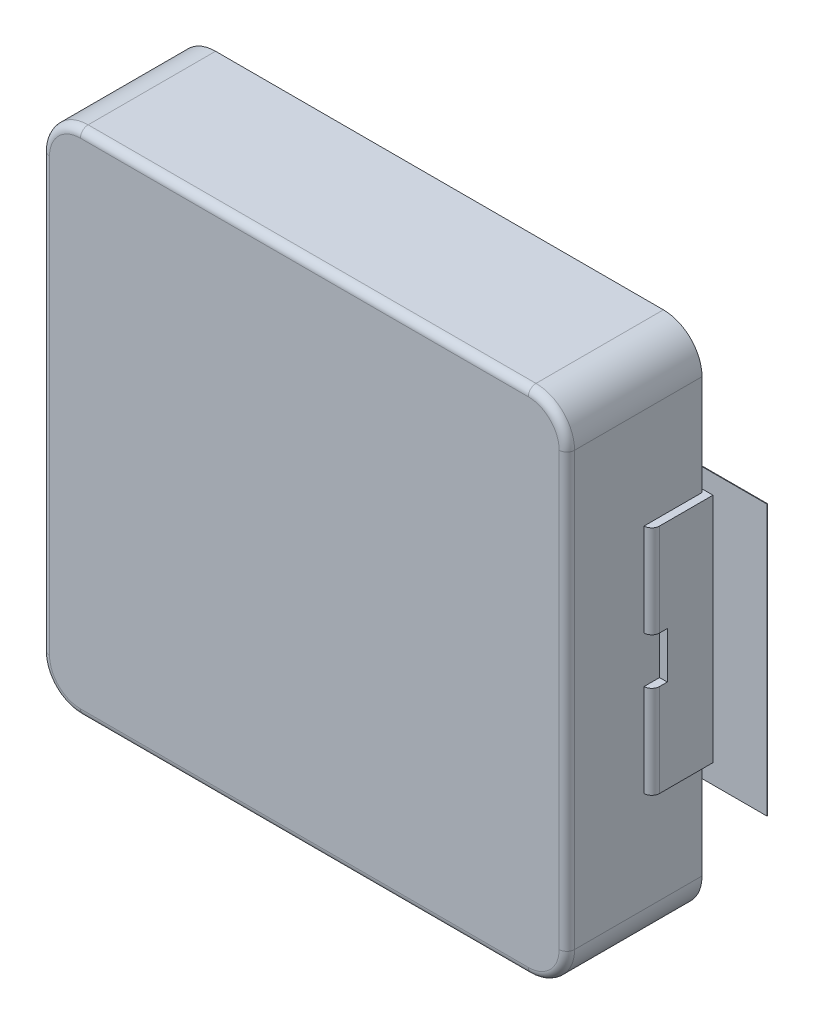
ISO-10303-21;
HEADER;
FILE_DESCRIPTION(('STEP AP214'),'2;1');
FILE_NAME('part.step','',(''),(''),'','','');
FILE_SCHEMA(('AUTOMOTIVE_DESIGN { 1 0 10303 214 1 1 1 1 }'));
ENDSEC;
DATA;
#1=APPLICATION_CONTEXT('core data for automotive mechanical design processes');
#2=APPLICATION_PROTOCOL_DEFINITION('international standard','automotive_design',2000,#1);
#3=PRODUCT_CONTEXT('',#1,'mechanical');
#4=PRODUCT('Part','Part','',(#3));
#5=PRODUCT_RELATED_PRODUCT_CATEGORY('part','',(#4));
#6=PRODUCT_DEFINITION_FORMATION('','',#4);
#7=PRODUCT_DEFINITION_CONTEXT('part definition',#1,'design');
#8=PRODUCT_DEFINITION('design','',#6,#7);
#9=PRODUCT_DEFINITION_SHAPE('','',#8);
#10=(LENGTH_UNIT() NAMED_UNIT(*) SI_UNIT(.MILLI.,.METRE.));
#11=(NAMED_UNIT(*) PLANE_ANGLE_UNIT() SI_UNIT($,.RADIAN.));
#12=(NAMED_UNIT(*) SI_UNIT($,.STERADIAN.) SOLID_ANGLE_UNIT());
#13=UNCERTAINTY_MEASURE_WITH_UNIT(LENGTH_MEASURE(1.E-05),#10,'distance_accuracy_value','');
#14=(GEOMETRIC_REPRESENTATION_CONTEXT(3) GLOBAL_UNCERTAINTY_ASSIGNED_CONTEXT((#13)) GLOBAL_UNIT_ASSIGNED_CONTEXT((#10,
#11,#12)) REPRESENTATION_CONTEXT('',''));
#15=CARTESIAN_POINT('',(0.,0.,0.));
#16=DIRECTION('',(0.,0.,1.));
#17=DIRECTION('',(1.,0.,0.));
#18=AXIS2_PLACEMENT_3D('',#15,#16,#17);
#19=CARTESIAN_POINT('',(3.50000000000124,-1.5000000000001,0.0762));
#20=DIRECTION('',(0.,0.,-1.));
#21=DIRECTION('',(-1.,0.,0.));
#22=AXIS2_PLACEMENT_3D('',#19,#20,#21);
#23=PLANE('',#22);
#24=DIRECTION('',(0.,1.,0.));
#25=VECTOR('',#24,1.);
#26=CARTESIAN_POINT('',(4.20000000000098,-1.75000000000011,0.0762));
#27=LINE('',#26,#25);
#28=CARTESIAN_POINT('',(4.20000000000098,-1.75000000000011,0.0762));
#29=VERTEX_POINT('',#28);
#30=CARTESIAN_POINT('',(4.20000000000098,1.75000000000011,0.0762));
#31=VERTEX_POINT('',#30);
#32=EDGE_CURVE('E429',#29,#31,#27,.T.);
#33=ORIENTED_EDGE('',*,*,#32,.F.);
#34=DIRECTION('',(1.,0.,0.));
#35=VECTOR('',#34,1.);
#36=CARTESIAN_POINT('',(1.25000000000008,-1.75000000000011,0.0762));
#37=LINE('',#36,#35);
#38=CARTESIAN_POINT('',(1.25000000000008,-1.75000000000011,0.0762));
#39=VERTEX_POINT('',#38);
#40=EDGE_CURVE('E280',#39,#29,#37,.T.);
#41=ORIENTED_EDGE('',*,*,#40,.F.);
#42=DIRECTION('',(0.,1.,0.));
#43=VECTOR('',#42,1.);
#44=CARTESIAN_POINT('',(1.25000000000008,1.75000000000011,0.0762));
#45=LINE('',#44,#43);
#46=CARTESIAN_POINT('',(1.25000000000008,1.75000000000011,0.0762));
#47=VERTEX_POINT('',#46);
#48=EDGE_CURVE('E419',#47,#39,#45,.F.);
#49=ORIENTED_EDGE('',*,*,#48,.F.);
#50=DIRECTION('',(1.,0.,0.));
#51=VECTOR('',#50,1.);
#52=CARTESIAN_POINT('',(4.20000000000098,1.75000000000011,0.0762));
#53=LINE('',#52,#51);
#54=EDGE_CURVE('E424',#31,#47,#53,.F.);
#55=ORIENTED_EDGE('',*,*,#54,.F.);
#56=EDGE_LOOP('',(#33,#41,#49,#55));
#57=FACE_BOUND('',#56,.T.);
#58=ADVANCED_FACE('F16',(#57),#23,.T.);
#59=CARTESIAN_POINT('',(3.50000000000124,-1.5000000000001,0.0762));
#60=DIRECTION('',(0.,0.,-1.));
#61=DIRECTION('',(-1.,0.,0.));
#62=AXIS2_PLACEMENT_3D('',#59,#60,#61);
#63=PLANE('',#62);
#64=DIRECTION('',(0.,1.,0.));
#65=VECTOR('',#64,1.);
#66=CARTESIAN_POINT('',(-1.25000000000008,-1.75000000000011,0.0762));
#67=LINE('',#66,#65);
#68=CARTESIAN_POINT('',(-1.25000000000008,-1.75000000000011,0.0762));
#69=VERTEX_POINT('',#68);
#70=CARTESIAN_POINT('',(-1.25000000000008,1.75000000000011,0.0762));
#71=VERTEX_POINT('',#70);
#72=EDGE_CURVE('E289',#69,#71,#67,.T.);
#73=ORIENTED_EDGE('',*,*,#72,.F.);
#74=DIRECTION('',(1.,0.,0.));
#75=VECTOR('',#74,1.);
#76=CARTESIAN_POINT('',(-4.20000000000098,-1.75000000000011,0.0762));
#77=LINE('',#76,#75);
#78=CARTESIAN_POINT('',(-4.20000000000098,-1.75000000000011,0.0762));
#79=VERTEX_POINT('',#78);
#80=EDGE_CURVE('E488',#79,#69,#77,.T.);
#81=ORIENTED_EDGE('',*,*,#80,.F.);
#82=DIRECTION('',(0.,1.,0.));
#83=VECTOR('',#82,1.);
#84=CARTESIAN_POINT('',(-4.20000000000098,1.75000000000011,0.0762));
#85=LINE('',#84,#83);
#86=CARTESIAN_POINT('',(-4.20000000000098,1.75000000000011,0.0762));
#87=VERTEX_POINT('',#86);
#88=EDGE_CURVE('E536',#87,#79,#85,.F.);
#89=ORIENTED_EDGE('',*,*,#88,.F.);
#90=DIRECTION('',(1.,0.,0.));
#91=VECTOR('',#90,1.);
#92=CARTESIAN_POINT('',(-1.25000000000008,1.75000000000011,0.0762));
#93=LINE('',#92,#91);
#94=EDGE_CURVE('E541',#71,#87,#93,.F.);
#95=ORIENTED_EDGE('',*,*,#94,.F.);
#96=EDGE_LOOP('',(#73,#81,#89,#95));
#97=FACE_BOUND('',#96,.T.);
#98=ADVANCED_FACE('F553',(#97),#63,.T.);
#99=CARTESIAN_POINT('',(4.20000000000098,-1.75000000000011,0.0762));
#100=DIRECTION('',(1.,0.,0.));
#101=DIRECTION('',(0.,0.,-1.));
#102=AXIS2_PLACEMENT_3D('',#99,#100,#101);
#103=PLANE('',#102);
#104=DIRECTION('',(0.,0.,-1.));
#105=VECTOR('',#104,1.);
#106=CARTESIAN_POINT('',(4.20000000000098,-1.75000000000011,0.0762));
#107=LINE('',#106,#105);
#108=CARTESIAN_POINT('',(4.20000000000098,-1.75000000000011,0.0841999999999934));
#109=VERTEX_POINT('',#108);
#110=EDGE_CURVE('E416',#29,#109,#107,.F.);
#111=ORIENTED_EDGE('',*,*,#110,.F.);
#112=ORIENTED_EDGE('',*,*,#32,.T.);
#113=DIRECTION('',(0.,0.,1.));
#114=VECTOR('',#113,1.);
#115=CARTESIAN_POINT('',(4.20000000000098,1.75000000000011,0.0762));
#116=LINE('',#115,#114);
#117=CARTESIAN_POINT('',(4.20000000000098,1.75000000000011,0.0841999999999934));
#118=VERTEX_POINT('',#117);
#119=EDGE_CURVE('E426',#118,#31,#116,.F.);
#120=ORIENTED_EDGE('',*,*,#119,.F.);
#121=DIRECTION('',(0.,1.,0.));
#122=VECTOR('',#121,1.);
#123=CARTESIAN_POINT('',(4.20000000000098,0.,0.0841999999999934));
#124=LINE('',#123,#122);
#125=EDGE_CURVE('E466',#109,#118,#124,.T.);
#126=ORIENTED_EDGE('',*,*,#125,.F.);
#127=EDGE_LOOP('',(#111,#112,#120,#126));
#128=FACE_BOUND('',#127,.T.);
#129=ADVANCED_FACE('F1321',(#128),#103,.T.);
#130=CARTESIAN_POINT('',(4.20000000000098,1.75000000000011,0.0762));
#131=DIRECTION('',(0.,1.,0.));
#132=DIRECTION('',(0.,0.,1.));
#133=AXIS2_PLACEMENT_3D('',#130,#131,#132);
#134=PLANE('',#133);
#135=ORIENTED_EDGE('',*,*,#119,.T.);
#136=ORIENTED_EDGE('',*,*,#54,.T.);
#137=DIRECTION('',(0.,0.,1.));
#138=VECTOR('',#137,1.);
#139=CARTESIAN_POINT('',(1.25000000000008,1.75000000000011,0.0762));
#140=LINE('',#139,#138);
#141=CARTESIAN_POINT('',(1.25000000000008,1.75000000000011,0.0841999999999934));
#142=VERTEX_POINT('',#141);
#143=EDGE_CURVE('E421',#142,#47,#140,.F.);
#144=ORIENTED_EDGE('',*,*,#143,.F.);
#145=DIRECTION('',(1.,0.,0.));
#146=VECTOR('',#145,1.);
#147=CARTESIAN_POINT('',(0.,1.75000000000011,0.0841999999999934));
#148=LINE('',#147,#146);
#149=EDGE_CURVE('E575',#118,#142,#148,.F.);
#150=ORIENTED_EDGE('',*,*,#149,.F.);
#151=EDGE_LOOP('',(#135,#136,#144,#150));
#152=FACE_BOUND('',#151,.T.);
#153=ADVANCED_FACE('F1312',(#152),#134,.T.);
#154=CARTESIAN_POINT('',(1.25000000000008,1.75000000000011,0.0762));
#155=DIRECTION('',(-1.,0.,0.));
#156=DIRECTION('',(0.,0.,1.));
#157=AXIS2_PLACEMENT_3D('',#154,#155,#156);
#158=PLANE('',#157);
#159=ORIENTED_EDGE('',*,*,#143,.T.);
#160=ORIENTED_EDGE('',*,*,#48,.T.);
#161=DIRECTION('',(0.,0.,-1.));
#162=VECTOR('',#161,1.);
#163=CARTESIAN_POINT('',(1.25000000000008,-1.75000000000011,0.0762));
#164=LINE('',#163,#162);
#165=CARTESIAN_POINT('',(1.25000000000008,-1.75000000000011,0.0841999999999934));
#166=VERTEX_POINT('',#165);
#167=EDGE_CURVE('E413',#166,#39,#164,.T.);
#168=ORIENTED_EDGE('',*,*,#167,.F.);
#169=DIRECTION('',(0.,1.,0.));
#170=VECTOR('',#169,1.);
#171=CARTESIAN_POINT('',(1.25000000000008,0.,0.0841999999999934));
#172=LINE('',#171,#170);
#173=EDGE_CURVE('E572',#142,#166,#172,.F.);
#174=ORIENTED_EDGE('',*,*,#173,.F.);
#175=EDGE_LOOP('',(#159,#160,#168,#174));
#176=FACE_BOUND('',#175,.T.);
#177=ADVANCED_FACE('F1303',(#176),#158,.T.);
#178=CARTESIAN_POINT('',(1.25000000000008,-1.75000000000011,0.0762));
#179=DIRECTION('',(0.,-1.,0.));
#180=DIRECTION('',(0.,0.,-1.));
#181=AXIS2_PLACEMENT_3D('',#178,#179,#180);
#182=PLANE('',#181);
#183=ORIENTED_EDGE('',*,*,#167,.T.);
#184=ORIENTED_EDGE('',*,*,#40,.T.);
#185=ORIENTED_EDGE('',*,*,#110,.T.);
#186=DIRECTION('',(1.,0.,0.));
#187=VECTOR('',#186,1.);
#188=CARTESIAN_POINT('',(0.,-1.75000000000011,0.0841999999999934));
#189=LINE('',#188,#187);
#190=EDGE_CURVE('E306',#166,#109,#189,.T.);
#191=ORIENTED_EDGE('',*,*,#190,.F.);
#192=EDGE_LOOP('',(#183,#184,#185,#191));
#193=FACE_BOUND('',#192,.T.);
#194=ADVANCED_FACE('F1295',(#193),#182,.T.);
#195=CARTESIAN_POINT('',(3.50000000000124,-1.5000000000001,0.876200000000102));
#196=DIRECTION('',(0.,-1.,0.));
#197=DIRECTION('',(0.,0.,-1.));
#198=AXIS2_PLACEMENT_3D('',#195,#196,#197);
#199=PLANE('',#198);
#200=DIRECTION('',(0.,0.,-1.));
#201=VECTOR('',#200,1.);
#202=CARTESIAN_POINT('',(1.70000000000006,-1.5000000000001,0.876200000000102));
#203=LINE('',#202,#201);
#204=CARTESIAN_POINT('',(1.70000000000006,-1.5000000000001,0.126200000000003));
#205=VERTEX_POINT('',#204);
#206=CARTESIAN_POINT('',(1.70000000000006,-1.5000000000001,0.0841999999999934));
#207=VERTEX_POINT('',#206);
#208=EDGE_CURVE('E353',#205,#207,#203,.T.);
#209=ORIENTED_EDGE('',*,*,#208,.T.);
#210=DIRECTION('',(1.,0.,0.));
#211=VECTOR('',#210,1.);
#212=CARTESIAN_POINT('',(0.,-1.5000000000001,0.0841999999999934));
#213=LINE('',#212,#211);
#214=CARTESIAN_POINT('',(3.50000000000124,-1.5000000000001,0.0841999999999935));
#215=VERTEX_POINT('',#214);
#216=EDGE_CURVE('E285',#215,#207,#213,.F.);
#217=ORIENTED_EDGE('',*,*,#216,.F.);
#218=DIRECTION('',(0.,0.,-1.));
#219=VECTOR('',#218,1.);
#220=CARTESIAN_POINT('',(3.50000000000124,-1.5000000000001,1.876298));
#221=LINE('',#220,#219);
#222=CARTESIAN_POINT('',(3.50000000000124,-1.5000000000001,0.776199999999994));
#223=VERTEX_POINT('',#222);
#224=EDGE_CURVE('E282',#223,#215,#221,.T.);
#225=ORIENTED_EDGE('',*,*,#224,.F.);
#226=CARTESIAN_POINT('',(3.3999999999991,-1.5000000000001,0.776199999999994));
#227=DIRECTION('',(0.,-1.,0.));
#228=DIRECTION('',(0.,0.,-1.));
#229=AXIS2_PLACEMENT_3D('',#226,#227,#228);
#230=CIRCLE('',#229,0.100000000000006);
#231=CARTESIAN_POINT('',(3.3999999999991,-1.5000000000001,0.876200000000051));
#232=VERTEX_POINT('',#231);
#233=EDGE_CURVE('E19',#223,#232,#230,.T.);
#234=ORIENTED_EDGE('',*,*,#233,.T.);
#235=DIRECTION('',(0.,0.,-1.));
#236=VECTOR('',#235,1.);
#237=CARTESIAN_POINT('',(3.3999999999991,-1.5000000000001,0.876200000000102));
#238=LINE('',#237,#236);
#239=CARTESIAN_POINT('',(3.3999999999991,-1.5000000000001,0.126200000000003));
#240=VERTEX_POINT('',#239);
#241=EDGE_CURVE('E279',#232,#240,#238,.T.);
#242=ORIENTED_EDGE('',*,*,#241,.T.);
#243=DIRECTION('',(1.,0.,0.));
#244=VECTOR('',#243,1.);
#245=CARTESIAN_POINT('',(3.50000000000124,-1.5000000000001,0.126200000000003));
#246=LINE('',#245,#244);
#247=EDGE_CURVE('E363',#240,#205,#246,.F.);
#248=ORIENTED_EDGE('',*,*,#247,.T.);
#249=EDGE_LOOP('',(#209,#217,#225,#234,#242,#248));
#250=FACE_BOUND('',#249,.T.);
#251=ADVANCED_FACE('F283',(#250),#199,.T.);
#252=CARTESIAN_POINT('',(3.50000000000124,1.5000000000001,0.0762));
#253=DIRECTION('',(0.,1.,0.));
#254=DIRECTION('',(0.,0.,1.));
#255=AXIS2_PLACEMENT_3D('',#252,#253,#254);
#256=PLANE('',#255);
#257=DIRECTION('',(0.,0.,-1.));
#258=VECTOR('',#257,1.);
#259=CARTESIAN_POINT('',(3.50000000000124,1.5000000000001,1.876298));
#260=LINE('',#259,#258);
#261=CARTESIAN_POINT('',(3.50000000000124,1.5000000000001,0.0841999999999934));
#262=VERTEX_POINT('',#261);
#263=CARTESIAN_POINT('',(3.50000000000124,1.5000000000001,0.776199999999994));
#264=VERTEX_POINT('',#263);
#265=EDGE_CURVE('E327',#262,#264,#260,.F.);
#266=ORIENTED_EDGE('',*,*,#265,.F.);
#267=DIRECTION('',(1.,0.,0.));
#268=VECTOR('',#267,1.);
#269=CARTESIAN_POINT('',(0.,1.5000000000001,0.0841999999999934));
#270=LINE('',#269,#268);
#271=CARTESIAN_POINT('',(1.70000000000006,1.5000000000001,0.0841999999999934));
#272=VERTEX_POINT('',#271);
#273=EDGE_CURVE('E305',#272,#262,#270,.T.);
#274=ORIENTED_EDGE('',*,*,#273,.F.);
#275=DIRECTION('',(0.,0.,1.));
#276=VECTOR('',#275,1.);
#277=CARTESIAN_POINT('',(1.70000000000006,1.5000000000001,0.0762));
#278=LINE('',#277,#276);
#279=CARTESIAN_POINT('',(1.70000000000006,1.5000000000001,0.126200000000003));
#280=VERTEX_POINT('',#279);
#281=EDGE_CURVE('E341',#272,#280,#278,.T.);
#282=ORIENTED_EDGE('',*,*,#281,.T.);
#283=DIRECTION('',(1.,0.,0.));
#284=VECTOR('',#283,1.);
#285=CARTESIAN_POINT('',(3.50000000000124,1.5000000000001,0.126200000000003));
#286=LINE('',#285,#284);
#287=CARTESIAN_POINT('',(3.3999999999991,1.5000000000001,0.126200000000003));
#288=VERTEX_POINT('',#287);
#289=EDGE_CURVE('E337',#280,#288,#286,.T.);
#290=ORIENTED_EDGE('',*,*,#289,.T.);
#291=DIRECTION('',(0.,0.,1.));
#292=VECTOR('',#291,1.);
#293=CARTESIAN_POINT('',(3.3999999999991,1.5000000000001,0.0762));
#294=LINE('',#293,#292);
#295=CARTESIAN_POINT('',(3.3999999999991,1.5000000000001,0.876200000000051));
#296=VERTEX_POINT('',#295);
#297=EDGE_CURVE('E340',#288,#296,#294,.T.);
#298=ORIENTED_EDGE('',*,*,#297,.T.);
#299=CARTESIAN_POINT('',(3.3999999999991,1.5000000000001,0.776199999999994));
#300=DIRECTION('',(0.,-1.,0.));
#301=DIRECTION('',(0.,0.,-1.));
#302=AXIS2_PLACEMENT_3D('',#299,#300,#301);
#303=CIRCLE('',#302,0.100000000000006);
#304=EDGE_CURVE('E330',#296,#264,#303,.F.);
#305=ORIENTED_EDGE('',*,*,#304,.T.);
#306=EDGE_LOOP('',(#266,#274,#282,#290,#298,#305));
#307=FACE_BOUND('',#306,.T.);
#308=ADVANCED_FACE('F946',(#307),#256,.T.);
#309=CARTESIAN_POINT('',(3.50000000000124,0.,1.876298));
#310=DIRECTION('',(1.,0.,0.));
#311=DIRECTION('',(0.,0.,-1.));
#312=AXIS2_PLACEMENT_3D('',#309,#310,#311);
#313=PLANE('',#312);
#314=ORIENTED_EDGE('',*,*,#224,.T.);
#315=DIRECTION('',(0.,1.,0.));
#316=VECTOR('',#315,1.);
#317=CARTESIAN_POINT('',(3.50000000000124,0.,0.0841999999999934));
#318=LINE('',#317,#316);
#319=EDGE_CURVE('E309',#262,#215,#318,.F.);
#320=ORIENTED_EDGE('',*,*,#319,.F.);
#321=ORIENTED_EDGE('',*,*,#265,.T.);
#322=DIRECTION('',(0.,1.,0.));
#323=VECTOR('',#322,1.);
#324=CARTESIAN_POINT('',(3.50000000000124,0.,0.776199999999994));
#325=LINE('',#324,#323);
#326=CARTESIAN_POINT('',(3.50000000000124,0.30000000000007,0.776199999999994));
#327=VERTEX_POINT('',#326);
#328=EDGE_CURVE('E322',#264,#327,#325,.F.);
#329=ORIENTED_EDGE('',*,*,#328,.T.);
#330=DIRECTION('',(0.,0.,-1.));
#331=VECTOR('',#330,1.);
#332=CARTESIAN_POINT('',(3.50000000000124,0.30000000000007,1.876298));
#333=LINE('',#332,#331);
#334=CARTESIAN_POINT('',(3.50000000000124,0.30000000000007,0.676199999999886));
#335=VERTEX_POINT('',#334);
#336=EDGE_CURVE('E317',#327,#335,#333,.T.);
#337=ORIENTED_EDGE('',*,*,#336,.T.);
#338=DIRECTION('',(0.,1.,0.));
#339=VECTOR('',#338,1.);
#340=CARTESIAN_POINT('',(3.50000000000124,0.,0.676199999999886));
#341=LINE('',#340,#339);
#342=CARTESIAN_POINT('',(3.50000000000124,-0.30000000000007,0.676199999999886));
#343=VERTEX_POINT('',#342);
#344=EDGE_CURVE('E296',#335,#343,#341,.F.);
#345=ORIENTED_EDGE('',*,*,#344,.T.);
#346=DIRECTION('',(0.,0.,-1.));
#347=VECTOR('',#346,1.);
#348=CARTESIAN_POINT('',(3.50000000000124,-0.30000000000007,1.876298));
#349=LINE('',#348,#347);
#350=CARTESIAN_POINT('',(3.50000000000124,-0.30000000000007,0.776199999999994));
#351=VERTEX_POINT('',#350);
#352=EDGE_CURVE('E294',#343,#351,#349,.F.);
#353=ORIENTED_EDGE('',*,*,#352,.T.);
#354=DIRECTION('',(0.,1.,0.));
#355=VECTOR('',#354,1.);
#356=CARTESIAN_POINT('',(3.50000000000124,0.,0.776199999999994));
#357=LINE('',#356,#355);
#358=EDGE_CURVE('E273',#351,#223,#357,.F.);
#359=ORIENTED_EDGE('',*,*,#358,.T.);
#360=EDGE_LOOP('',(#314,#320,#321,#329,#337,#345,#353,#359));
#361=FACE_BOUND('',#360,.T.);
#362=ADVANCED_FACE('F292',(#361),#313,.T.);
#363=CARTESIAN_POINT('',(-1.25000000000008,-1.75000000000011,0.0762));
#364=DIRECTION('',(1.,0.,0.));
#365=DIRECTION('',(0.,0.,-1.));
#366=AXIS2_PLACEMENT_3D('',#363,#364,#365);
#367=PLANE('',#366);
#368=DIRECTION('',(0.,0.,-1.));
#369=VECTOR('',#368,1.);
#370=CARTESIAN_POINT('',(-1.25000000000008,-1.75000000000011,0.0762));
#371=LINE('',#370,#369);
#372=CARTESIAN_POINT('',(-1.25000000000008,-1.75000000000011,0.0841999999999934));
#373=VERTEX_POINT('',#372);
#374=EDGE_CURVE('E533',#69,#373,#371,.F.);
#375=ORIENTED_EDGE('',*,*,#374,.F.);
#376=ORIENTED_EDGE('',*,*,#72,.T.);
#377=DIRECTION('',(0.,0.,1.));
#378=VECTOR('',#377,1.);
#379=CARTESIAN_POINT('',(-1.25000000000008,1.75000000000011,0.0762));
#380=LINE('',#379,#378);
#381=CARTESIAN_POINT('',(-1.25000000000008,1.75000000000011,0.0841999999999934));
#382=VERTEX_POINT('',#381);
#383=EDGE_CURVE('E542',#382,#71,#380,.F.);
#384=ORIENTED_EDGE('',*,*,#383,.F.);
#385=DIRECTION('',(0.,1.,0.));
#386=VECTOR('',#385,1.);
#387=CARTESIAN_POINT('',(-1.25000000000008,0.,0.0841999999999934));
#388=LINE('',#387,#386);
#389=EDGE_CURVE('E311',#373,#382,#388,.T.);
#390=ORIENTED_EDGE('',*,*,#389,.F.);
#391=EDGE_LOOP('',(#375,#376,#384,#390));
#392=FACE_BOUND('',#391,.T.);
#393=ADVANCED_FACE('F549',(#392),#367,.T.);
#394=CARTESIAN_POINT('',(-1.25000000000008,1.75000000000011,0.0762));
#395=DIRECTION('',(0.,1.,0.));
#396=DIRECTION('',(0.,0.,1.));
#397=AXIS2_PLACEMENT_3D('',#394,#395,#396);
#398=PLANE('',#397);
#399=ORIENTED_EDGE('',*,*,#383,.T.);
#400=ORIENTED_EDGE('',*,*,#94,.T.);
#401=DIRECTION('',(0.,0.,1.));
#402=VECTOR('',#401,1.);
#403=CARTESIAN_POINT('',(-4.20000000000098,1.75000000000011,0.0762));
#404=LINE('',#403,#402);
#405=CARTESIAN_POINT('',(-4.20000000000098,1.75000000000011,0.0841999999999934));
#406=VERTEX_POINT('',#405);
#407=EDGE_CURVE('E538',#406,#87,#404,.F.);
#408=ORIENTED_EDGE('',*,*,#407,.F.);
#409=DIRECTION('',(1.,0.,0.));
#410=VECTOR('',#409,1.);
#411=CARTESIAN_POINT('',(0.,1.75000000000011,0.0841999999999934));
#412=LINE('',#411,#410);
#413=EDGE_CURVE('E557',#382,#406,#412,.F.);
#414=ORIENTED_EDGE('',*,*,#413,.F.);
#415=EDGE_LOOP('',(#399,#400,#408,#414));
#416=FACE_BOUND('',#415,.T.);
#417=ADVANCED_FACE('F554',(#416),#398,.T.);
#418=CARTESIAN_POINT('',(-4.20000000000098,1.75000000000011,0.0762));
#419=DIRECTION('',(-1.,0.,0.));
#420=DIRECTION('',(0.,0.,1.));
#421=AXIS2_PLACEMENT_3D('',#418,#419,#420);
#422=PLANE('',#421);
#423=ORIENTED_EDGE('',*,*,#407,.T.);
#424=ORIENTED_EDGE('',*,*,#88,.T.);
#425=DIRECTION('',(0.,0.,-1.));
#426=VECTOR('',#425,1.);
#427=CARTESIAN_POINT('',(-4.20000000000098,-1.75000000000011,0.0762));
#428=LINE('',#427,#426);
#429=CARTESIAN_POINT('',(-4.20000000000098,-1.75000000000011,0.0841999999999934));
#430=VERTEX_POINT('',#429);
#431=EDGE_CURVE('E530',#430,#79,#428,.T.);
#432=ORIENTED_EDGE('',*,*,#431,.F.);
#433=DIRECTION('',(0.,1.,0.));
#434=VECTOR('',#433,1.);
#435=CARTESIAN_POINT('',(-4.20000000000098,0.,0.0841999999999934));
#436=LINE('',#435,#434);
#437=EDGE_CURVE('E561',#406,#430,#436,.F.);
#438=ORIENTED_EDGE('',*,*,#437,.F.);
#439=EDGE_LOOP('',(#423,#424,#432,#438));
#440=FACE_BOUND('',#439,.T.);
#441=ADVANCED_FACE('F562',(#440),#422,.T.);
#442=CARTESIAN_POINT('',(-4.20000000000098,-1.75000000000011,0.0762));
#443=DIRECTION('',(0.,-1.,0.));
#444=DIRECTION('',(0.,0.,-1.));
#445=AXIS2_PLACEMENT_3D('',#442,#443,#444);
#446=PLANE('',#445);
#447=ORIENTED_EDGE('',*,*,#431,.T.);
#448=ORIENTED_EDGE('',*,*,#80,.T.);
#449=ORIENTED_EDGE('',*,*,#374,.T.);
#450=DIRECTION('',(1.,0.,0.));
#451=VECTOR('',#450,1.);
#452=CARTESIAN_POINT('',(0.,-1.75000000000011,0.0841999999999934));
#453=LINE('',#452,#451);
#454=EDGE_CURVE('E495',#430,#373,#453,.T.);
#455=ORIENTED_EDGE('',*,*,#454,.F.);
#456=EDGE_LOOP('',(#447,#448,#449,#455));
#457=FACE_BOUND('',#456,.T.);
#458=ADVANCED_FACE('F672',(#457),#446,.T.);
#459=CARTESIAN_POINT('',(-3.50000000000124,1.5000000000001,0.0762));
#460=DIRECTION('',(0.,-1.,0.));
#461=DIRECTION('',(0.,0.,-1.));
#462=AXIS2_PLACEMENT_3D('',#459,#460,#461);
#463=PLANE('',#462);
#464=DIRECTION('',(1.,0.,0.));
#465=VECTOR('',#464,1.);
#466=CARTESIAN_POINT('',(-3.50000000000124,1.5000000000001,0.876200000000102));
#467=LINE('',#466,#465);
#468=CARTESIAN_POINT('',(-3.3999999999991,1.5000000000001,0.876200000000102));
#469=VERTEX_POINT('',#468);
#470=CARTESIAN_POINT('',(-3.50000000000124,1.5000000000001,0.876200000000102));
#471=VERTEX_POINT('',#470);
#472=EDGE_CURVE('E456',#469,#471,#467,.F.);
#473=ORIENTED_EDGE('',*,*,#472,.F.);
#474=DIRECTION('',(0.,0.,-1.));
#475=VECTOR('',#474,1.);
#476=CARTESIAN_POINT('',(-3.3999999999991,1.5000000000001,0.0762));
#477=LINE('',#476,#475);
#478=CARTESIAN_POINT('',(-3.3999999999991,1.5000000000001,0.126200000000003));
#479=VERTEX_POINT('',#478);
#480=EDGE_CURVE('E471',#479,#469,#477,.F.);
#481=ORIENTED_EDGE('',*,*,#480,.F.);
#482=DIRECTION('',(1.,0.,0.));
#483=VECTOR('',#482,1.);
#484=CARTESIAN_POINT('',(-3.50000000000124,1.5000000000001,0.126200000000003));
#485=LINE('',#484,#483);
#486=CARTESIAN_POINT('',(-1.70000000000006,1.5000000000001,0.126200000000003));
#487=VERTEX_POINT('',#486);
#488=EDGE_CURVE('E469',#487,#479,#485,.F.);
#489=ORIENTED_EDGE('',*,*,#488,.F.);
#490=DIRECTION('',(0.,0.,-1.));
#491=VECTOR('',#490,1.);
#492=CARTESIAN_POINT('',(-1.70000000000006,1.5000000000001,0.0762));
#493=LINE('',#492,#491);
#494=CARTESIAN_POINT('',(-1.70000000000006,1.5000000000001,0.0841999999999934));
#495=VERTEX_POINT('',#494);
#496=EDGE_CURVE('E472',#495,#487,#493,.F.);
#497=ORIENTED_EDGE('',*,*,#496,.F.);
#498=DIRECTION('',(1.,0.,0.));
#499=VECTOR('',#498,1.);
#500=CARTESIAN_POINT('',(0.,1.5000000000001,0.0841999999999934));
#501=LINE('',#500,#499);
#502=CARTESIAN_POINT('',(-3.50000000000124,1.5000000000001,0.0841999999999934));
#503=VERTEX_POINT('',#502);
#504=EDGE_CURVE('E491',#503,#495,#501,.T.);
#505=ORIENTED_EDGE('',*,*,#504,.F.);
#506=DIRECTION('',(0.,0.,-1.));
#507=VECTOR('',#506,1.);
#508=CARTESIAN_POINT('',(-3.50000000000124,1.5000000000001,1.876298));
#509=LINE('',#508,#507);
#510=EDGE_CURVE('E446',#503,#471,#509,.F.);
#511=ORIENTED_EDGE('',*,*,#510,.T.);
#512=EDGE_LOOP('',(#473,#481,#489,#497,#505,#511));
#513=FACE_BOUND('',#512,.T.);
#514=ADVANCED_FACE('F514',(#513),#463,.F.);
#515=CARTESIAN_POINT('',(-3.50000000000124,-1.5000000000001,0.876200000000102));
#516=DIRECTION('',(0.,1.,0.));
#517=DIRECTION('',(0.,0.,1.));
#518=AXIS2_PLACEMENT_3D('',#515,#516,#517);
#519=PLANE('',#518);
#520=DIRECTION('',(1.,0.,0.));
#521=VECTOR('',#520,1.);
#522=CARTESIAN_POINT('',(-3.50000000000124,-1.5000000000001,0.126200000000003));
#523=LINE('',#522,#521);
#524=CARTESIAN_POINT('',(-3.3999999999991,-1.5000000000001,0.126200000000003));
#525=VERTEX_POINT('',#524);
#526=CARTESIAN_POINT('',(-1.70000000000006,-1.5000000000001,0.126200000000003));
#527=VERTEX_POINT('',#526);
#528=EDGE_CURVE('E433',#525,#527,#523,.T.);
#529=ORIENTED_EDGE('',*,*,#528,.F.);
#530=DIRECTION('',(0.,0.,1.));
#531=VECTOR('',#530,1.);
#532=CARTESIAN_POINT('',(-3.3999999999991,-1.5000000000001,0.876200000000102));
#533=LINE('',#532,#531);
#534=CARTESIAN_POINT('',(-3.3999999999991,-1.5000000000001,0.876200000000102));
#535=VERTEX_POINT('',#534);
#536=EDGE_CURVE('E431',#535,#525,#533,.F.);
#537=ORIENTED_EDGE('',*,*,#536,.F.);
#538=DIRECTION('',(1.,0.,0.));
#539=VECTOR('',#538,1.);
#540=CARTESIAN_POINT('',(-3.50000000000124,-1.5000000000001,0.876200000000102));
#541=LINE('',#540,#539);
#542=CARTESIAN_POINT('',(-3.50000000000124,-1.5000000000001,0.876200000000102));
#543=VERTEX_POINT('',#542);
#544=EDGE_CURVE('E434',#543,#535,#541,.T.);
#545=ORIENTED_EDGE('',*,*,#544,.F.);
#546=DIRECTION('',(0.,0.,-1.));
#547=VECTOR('',#546,1.);
#548=CARTESIAN_POINT('',(-3.50000000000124,-1.5000000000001,1.876298));
#549=LINE('',#548,#547);
#550=CARTESIAN_POINT('',(-3.50000000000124,-1.5000000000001,0.0841999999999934));
#551=VERTEX_POINT('',#550);
#552=EDGE_CURVE('E461',#543,#551,#549,.T.);
#553=ORIENTED_EDGE('',*,*,#552,.T.);
#554=DIRECTION('',(1.,0.,0.));
#555=VECTOR('',#554,1.);
#556=CARTESIAN_POINT('',(0.,-1.5000000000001,0.0841999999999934));
#557=LINE('',#556,#555);
#558=CARTESIAN_POINT('',(-1.70000000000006,-1.5000000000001,0.0841999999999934));
#559=VERTEX_POINT('',#558);
#560=EDGE_CURVE('E494',#559,#551,#557,.F.);
#561=ORIENTED_EDGE('',*,*,#560,.F.);
#562=DIRECTION('',(0.,0.,1.));
#563=VECTOR('',#562,1.);
#564=CARTESIAN_POINT('',(-1.70000000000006,-1.5000000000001,0.876200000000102));
#565=LINE('',#564,#563);
#566=EDGE_CURVE('E438',#527,#559,#565,.F.);
#567=ORIENTED_EDGE('',*,*,#566,.F.);
#568=EDGE_LOOP('',(#529,#537,#545,#553,#561,#567));
#569=FACE_BOUND('',#568,.T.);
#570=ADVANCED_FACE('F680',(#569),#519,.F.);
#571=CARTESIAN_POINT('',(-3.50000000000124,0.,1.876298));
#572=DIRECTION('',(1.,0.,0.));
#573=DIRECTION('',(0.,0.,-1.));
#574=AXIS2_PLACEMENT_3D('',#571,#572,#573);
#575=PLANE('',#574);
#576=DIRECTION('',(0.,1.,0.));
#577=VECTOR('',#576,1.);
#578=CARTESIAN_POINT('',(-3.50000000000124,0.,0.876200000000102));
#579=LINE('',#578,#577);
#580=CARTESIAN_POINT('',(-3.50000000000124,-0.30000000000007,0.876200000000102));
#581=VERTEX_POINT('',#580);
#582=EDGE_CURVE('E459',#581,#543,#579,.F.);
#583=ORIENTED_EDGE('',*,*,#582,.F.);
#584=DIRECTION('',(0.,0.,-1.));
#585=VECTOR('',#584,1.);
#586=CARTESIAN_POINT('',(-3.50000000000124,-0.30000000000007,1.876298));
#587=LINE('',#586,#585);
#588=CARTESIAN_POINT('',(-3.50000000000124,-0.30000000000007,0.676199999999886));
#589=VERTEX_POINT('',#588);
#590=EDGE_CURVE('E462',#589,#581,#587,.F.);
#591=ORIENTED_EDGE('',*,*,#590,.F.);
#592=DIRECTION('',(0.,1.,0.));
#593=VECTOR('',#592,1.);
#594=CARTESIAN_POINT('',(-3.50000000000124,0.,0.676199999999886));
#595=LINE('',#594,#593);
#596=CARTESIAN_POINT('',(-3.50000000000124,0.30000000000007,0.676199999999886));
#597=VERTEX_POINT('',#596);
#598=EDGE_CURVE('E581',#597,#589,#595,.F.);
#599=ORIENTED_EDGE('',*,*,#598,.F.);
#600=DIRECTION('',(0.,0.,-1.));
#601=VECTOR('',#600,1.);
#602=CARTESIAN_POINT('',(-3.50000000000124,0.30000000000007,1.876298));
#603=LINE('',#602,#601);
#604=CARTESIAN_POINT('',(-3.50000000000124,0.30000000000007,0.876200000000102));
#605=VERTEX_POINT('',#604);
#606=EDGE_CURVE('E524',#605,#597,#603,.T.);
#607=ORIENTED_EDGE('',*,*,#606,.F.);
#608=DIRECTION('',(0.,1.,0.));
#609=VECTOR('',#608,1.);
#610=CARTESIAN_POINT('',(-3.50000000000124,0.,0.876200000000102));
#611=LINE('',#610,#609);
#612=EDGE_CURVE('E522',#471,#605,#611,.F.);
#613=ORIENTED_EDGE('',*,*,#612,.F.);
#614=ORIENTED_EDGE('',*,*,#510,.F.);
#615=DIRECTION('',(0.,1.,0.));
#616=VECTOR('',#615,1.);
#617=CARTESIAN_POINT('',(-3.50000000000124,0.,0.0841999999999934));
#618=LINE('',#617,#616);
#619=EDGE_CURVE('E360',#551,#503,#618,.T.);
#620=ORIENTED_EDGE('',*,*,#619,.F.);
#621=ORIENTED_EDGE('',*,*,#552,.F.);
#622=EDGE_LOOP('',(#583,#591,#599,#607,#613,#614,#620,#621));
#623=FACE_BOUND('',#622,.T.);
#624=ADVANCED_FACE('F519',(#623),#575,.F.);
#625=CARTESIAN_POINT('',(0.,0.,0.0841999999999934));
#626=DIRECTION('',(0.,0.,1.));
#627=DIRECTION('',(1.,0.,0.));
#628=AXIS2_PLACEMENT_3D('',#625,#626,#627);
#629=PLANE('',#628);
#630=ORIENTED_EDGE('',*,*,#273,.T.);
#631=ORIENTED_EDGE('',*,*,#319,.T.);
#632=ORIENTED_EDGE('',*,*,#216,.T.);
#633=DIRECTION('',(0.,1.,0.));
#634=VECTOR('',#633,1.);
#635=CARTESIAN_POINT('',(1.70000000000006,0.,0.0841999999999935));
#636=LINE('',#635,#634);
#637=EDGE_CURVE('E356',#207,#272,#636,.T.);
#638=ORIENTED_EDGE('',*,*,#637,.T.);
#639=EDGE_LOOP('',(#630,#631,#632,#638));
#640=FACE_BOUND('',#639,.T.);
#641=ORIENTED_EDGE('',*,*,#173,.T.);
#642=ORIENTED_EDGE('',*,*,#190,.T.);
#643=ORIENTED_EDGE('',*,*,#125,.T.);
#644=ORIENTED_EDGE('',*,*,#149,.T.);
#645=EDGE_LOOP('',(#641,#642,#643,#644));
#646=FACE_BOUND('',#645,.T.);
#647=ADVANCED_FACE('F1221',(#640,#646),#629,.T.);
#648=CARTESIAN_POINT('',(0.,0.,0.0841999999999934));
#649=DIRECTION('',(0.,0.,1.));
#650=DIRECTION('',(1.,0.,0.));
#651=AXIS2_PLACEMENT_3D('',#648,#649,#650);
#652=PLANE('',#651);
#653=ORIENTED_EDGE('',*,*,#560,.T.);
#654=ORIENTED_EDGE('',*,*,#619,.T.);
#655=ORIENTED_EDGE('',*,*,#504,.T.);
#656=DIRECTION('',(0.,1.,0.));
#657=VECTOR('',#656,1.);
#658=CARTESIAN_POINT('',(-1.70000000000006,0.,0.0841999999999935));
#659=LINE('',#658,#657);
#660=EDGE_CURVE('E359',#559,#495,#659,.T.);
#661=ORIENTED_EDGE('',*,*,#660,.F.);
#662=EDGE_LOOP('',(#653,#654,#655,#661));
#663=FACE_BOUND('',#662,.T.);
#664=ORIENTED_EDGE('',*,*,#437,.T.);
#665=ORIENTED_EDGE('',*,*,#454,.T.);
#666=ORIENTED_EDGE('',*,*,#389,.T.);
#667=ORIENTED_EDGE('',*,*,#413,.T.);
#668=EDGE_LOOP('',(#664,#665,#666,#667));
#669=FACE_BOUND('',#668,.T.);
#670=ADVANCED_FACE('F506',(#663,#669),#652,.T.);
#671=CARTESIAN_POINT('',(1.70000000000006,0.,1.876298));
#672=DIRECTION('',(1.,0.,0.));
#673=DIRECTION('',(0.,0.,-1.));
#674=AXIS2_PLACEMENT_3D('',#671,#672,#673);
#675=PLANE('',#674);
#676=DIRECTION('',(0.,1.,0.));
#677=VECTOR('',#676,1.);
#678=CARTESIAN_POINT('',(1.70000000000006,0.,0.126200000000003));
#679=LINE('',#678,#677);
#680=EDGE_CURVE('E344',#205,#280,#679,.T.);
#681=ORIENTED_EDGE('',*,*,#680,.T.);
#682=ORIENTED_EDGE('',*,*,#281,.F.);
#683=ORIENTED_EDGE('',*,*,#637,.F.);
#684=ORIENTED_EDGE('',*,*,#208,.F.);
#685=EDGE_LOOP('',(#681,#682,#683,#684));
#686=FACE_BOUND('',#685,.T.);
#687=ADVANCED_FACE('F950',(#686),#675,.F.);
#688=CARTESIAN_POINT('',(-1.70000000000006,0.,1.876298));
#689=DIRECTION('',(1.,0.,0.));
#690=DIRECTION('',(0.,0.,-1.));
#691=AXIS2_PLACEMENT_3D('',#688,#689,#690);
#692=PLANE('',#691);
#693=ORIENTED_EDGE('',*,*,#566,.T.);
#694=ORIENTED_EDGE('',*,*,#660,.T.);
#695=ORIENTED_EDGE('',*,*,#496,.T.);
#696=DIRECTION('',(0.,1.,0.));
#697=VECTOR('',#696,1.);
#698=CARTESIAN_POINT('',(-1.70000000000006,0.,0.126200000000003));
#699=LINE('',#698,#697);
#700=EDGE_CURVE('E388',#487,#527,#699,.F.);
#701=ORIENTED_EDGE('',*,*,#700,.T.);
#702=EDGE_LOOP('',(#693,#694,#695,#701));
#703=FACE_BOUND('',#702,.T.);
#704=ADVANCED_FACE('F500',(#703),#692,.T.);
#705=CARTESIAN_POINT('',(3.3999999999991,12.444840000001,0.776199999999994));
#706=DIRECTION('',(0.,-1.,0.));
#707=DIRECTION('',(0.,0.,-1.));
#708=AXIS2_PLACEMENT_3D('',#705,#706,#707);
#709=CYLINDRICAL_SURFACE('',#708,0.100000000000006);
#710=DIRECTION('',(0.,1.,0.));
#711=VECTOR('',#710,1.);
#712=CARTESIAN_POINT('',(3.3999999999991,-3.2999999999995,0.876200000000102));
#713=LINE('',#712,#711);
#714=CARTESIAN_POINT('',(3.3999999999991,-0.30000000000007,0.876200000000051));
#715=VERTEX_POINT('',#714);
#716=EDGE_CURVE('E276',#232,#715,#713,.T.);
#717=ORIENTED_EDGE('',*,*,#716,.F.);
#718=ORIENTED_EDGE('',*,*,#233,.F.);
#719=ORIENTED_EDGE('',*,*,#358,.F.);
#720=CARTESIAN_POINT('',(3.3999999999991,-0.300000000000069,0.776199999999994));
#721=DIRECTION('',(0.,-1.,0.));
#722=DIRECTION('',(0.,0.,-1.));
#723=AXIS2_PLACEMENT_3D('',#720,#721,#722);
#724=CIRCLE('',#723,0.100000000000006);
#725=EDGE_CURVE('E397',#715,#351,#724,.F.);
#726=ORIENTED_EDGE('',*,*,#725,.F.);
#727=EDGE_LOOP('',(#717,#718,#719,#726));
#728=FACE_BOUND('',#727,.T.);
#729=ADVANCED_FACE('F271',(#728),#709,.T.);
#730=CARTESIAN_POINT('',(3.50000000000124,-0.30000000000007,0.676199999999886));
#731=DIRECTION('',(0.,1.,0.));
#732=DIRECTION('',(0.,0.,1.));
#733=AXIS2_PLACEMENT_3D('',#730,#731,#732);
#734=PLANE('',#733);
#735=DIRECTION('',(0.,0.,-1.));
#736=VECTOR('',#735,1.);
#737=CARTESIAN_POINT('',(3.3999999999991,-0.30000000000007,0.0762));
#738=LINE('',#737,#736);
#739=CARTESIAN_POINT('',(3.3999999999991,-0.30000000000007,0.676199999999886));
#740=VERTEX_POINT('',#739);
#741=EDGE_CURVE('E658',#715,#740,#738,.T.);
#742=ORIENTED_EDGE('',*,*,#741,.F.);
#743=ORIENTED_EDGE('',*,*,#725,.T.);
#744=ORIENTED_EDGE('',*,*,#352,.F.);
#745=DIRECTION('',(1.,0.,0.));
#746=VECTOR('',#745,1.);
#747=CARTESIAN_POINT('',(3.50000000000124,-0.30000000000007,0.676199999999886));
#748=LINE('',#747,#746);
#749=EDGE_CURVE('E398',#740,#343,#748,.T.);
#750=ORIENTED_EDGE('',*,*,#749,.F.);
#751=EDGE_LOOP('',(#742,#743,#744,#750));
#752=FACE_BOUND('',#751,.T.);
#753=ADVANCED_FACE('F1183',(#752),#734,.T.);
#754=CARTESIAN_POINT('',(3.50000000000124,0.30000000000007,0.676199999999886));
#755=DIRECTION('',(0.,0.,1.));
#756=DIRECTION('',(1.,0.,0.));
#757=AXIS2_PLACEMENT_3D('',#754,#755,#756);
#758=PLANE('',#757);
#759=DIRECTION('',(1.,0.,0.));
#760=VECTOR('',#759,1.);
#761=CARTESIAN_POINT('',(3.50000000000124,0.30000000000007,0.676199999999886));
#762=LINE('',#761,#760);
#763=CARTESIAN_POINT('',(3.3999999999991,0.30000000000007,0.676199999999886));
#764=VERTEX_POINT('',#763);
#765=EDGE_CURVE('E396',#764,#335,#762,.T.);
#766=ORIENTED_EDGE('',*,*,#765,.F.);
#767=DIRECTION('',(0.,1.,0.));
#768=VECTOR('',#767,1.);
#769=CARTESIAN_POINT('',(3.3999999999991,-3.2999999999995,0.676199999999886));
#770=LINE('',#769,#768);
#771=EDGE_CURVE('E649',#740,#764,#770,.T.);
#772=ORIENTED_EDGE('',*,*,#771,.F.);
#773=ORIENTED_EDGE('',*,*,#749,.T.);
#774=ORIENTED_EDGE('',*,*,#344,.F.);
#775=EDGE_LOOP('',(#766,#772,#773,#774));
#776=FACE_BOUND('',#775,.T.);
#777=ADVANCED_FACE('F1174',(#776),#758,.T.);
#778=CARTESIAN_POINT('',(3.50000000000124,0.30000000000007,0.876200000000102));
#779=DIRECTION('',(0.,-1.,0.));
#780=DIRECTION('',(0.,0.,-1.));
#781=AXIS2_PLACEMENT_3D('',#778,#779,#780);
#782=PLANE('',#781);
#783=ORIENTED_EDGE('',*,*,#336,.F.);
#784=CARTESIAN_POINT('',(3.3999999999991,0.300000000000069,0.776199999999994));
#785=DIRECTION('',(0.,-1.,0.));
#786=DIRECTION('',(0.,0.,-1.));
#787=AXIS2_PLACEMENT_3D('',#784,#785,#786);
#788=CIRCLE('',#787,0.100000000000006);
#789=CARTESIAN_POINT('',(3.3999999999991,0.30000000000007,0.876200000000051));
#790=VERTEX_POINT('',#789);
#791=EDGE_CURVE('E392',#790,#327,#788,.F.);
#792=ORIENTED_EDGE('',*,*,#791,.F.);
#793=DIRECTION('',(0.,0.,-1.));
#794=VECTOR('',#793,1.);
#795=CARTESIAN_POINT('',(3.3999999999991,0.30000000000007,0.0762));
#796=LINE('',#795,#794);
#797=EDGE_CURVE('E646',#764,#790,#796,.F.);
#798=ORIENTED_EDGE('',*,*,#797,.F.);
#799=ORIENTED_EDGE('',*,*,#765,.T.);
#800=EDGE_LOOP('',(#783,#792,#798,#799));
#801=FACE_BOUND('',#800,.T.);
#802=ADVANCED_FACE('F1165',(#801),#782,.T.);
#803=CARTESIAN_POINT('',(3.3999999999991,12.444840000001,0.776199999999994));
#804=DIRECTION('',(0.,-1.,0.));
#805=DIRECTION('',(0.,0.,-1.));
#806=AXIS2_PLACEMENT_3D('',#803,#804,#805);
#807=CYLINDRICAL_SURFACE('',#806,0.100000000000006);
#808=DIRECTION('',(0.,1.,0.));
#809=VECTOR('',#808,1.);
#810=CARTESIAN_POINT('',(3.3999999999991,-3.2999999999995,0.876200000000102));
#811=LINE('',#810,#809);
#812=EDGE_CURVE('E641',#790,#296,#811,.T.);
#813=ORIENTED_EDGE('',*,*,#812,.F.);
#814=ORIENTED_EDGE('',*,*,#791,.T.);
#815=ORIENTED_EDGE('',*,*,#328,.F.);
#816=ORIENTED_EDGE('',*,*,#304,.F.);
#817=EDGE_LOOP('',(#813,#814,#815,#816));
#818=FACE_BOUND('',#817,.T.);
#819=ADVANCED_FACE('F1155',(#818),#807,.T.);
#820=CARTESIAN_POINT('',(2.9000000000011,2.79999999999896,4.2229057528));
#821=DIRECTION('',(0.,0.,-1.));
#822=DIRECTION('',(-1.,0.,0.));
#823=AXIS2_PLACEMENT_3D('',#820,#821,#822);
#824=CYLINDRICAL_SURFACE('',#823,0.500000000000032);
#825=DIRECTION('',(0.,0.,-1.));
#826=VECTOR('',#825,1.);
#827=CARTESIAN_POINT('',(3.3999999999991,2.79999999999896,0.0762));
#828=LINE('',#827,#826);
#829=CARTESIAN_POINT('',(3.3999999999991,2.79999999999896,0.126200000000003));
#830=VERTEX_POINT('',#829);
#831=CARTESIAN_POINT('',(3.40000000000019,2.79999999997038,1.77629799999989));
#832=VERTEX_POINT('',#831);
#833=EDGE_CURVE('E640',#830,#832,#828,.F.);
#834=ORIENTED_EDGE('',*,*,#833,.F.);
#835=CARTESIAN_POINT('',(2.9000000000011,2.79999999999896,0.126200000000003));
#836=DIRECTION('',(0.,0.,-1.));
#837=DIRECTION('',(-1.,0.,0.));
#838=AXIS2_PLACEMENT_3D('',#835,#836,#837);
#839=CIRCLE('',#838,0.500000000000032);
#840=CARTESIAN_POINT('',(2.89999999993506,3.2999999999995,0.126200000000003));
#841=VERTEX_POINT('',#840);
#842=EDGE_CURVE('E347',#830,#841,#839,.F.);
#843=ORIENTED_EDGE('',*,*,#842,.T.);
#844=DIRECTION('',(0.,0.,1.));
#845=VECTOR('',#844,1.);
#846=CARTESIAN_POINT('',(2.89999999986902,3.2999999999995,0.0762));
#847=LINE('',#846,#845);
#848=CARTESIAN_POINT('',(2.89999999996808,3.29999999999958,1.77629799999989));
#849=VERTEX_POINT('',#848);
#850=EDGE_CURVE('E629',#849,#841,#847,.F.);
#851=ORIENTED_EDGE('',*,*,#850,.F.);
#852=CARTESIAN_POINT('',(2.9000000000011,2.79999999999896,1.77629799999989));
#853=DIRECTION('',(0.,0.,-1.));
#854=DIRECTION('',(-1.,0.,0.));
#855=AXIS2_PLACEMENT_3D('',#852,#853,#854);
#856=CIRCLE('',#855,0.500000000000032);
#857=EDGE_CURVE('E395',#849,#832,#856,.T.);
#858=ORIENTED_EDGE('',*,*,#857,.T.);
#859=EDGE_LOOP('',(#834,#843,#851,#858));
#860=FACE_BOUND('',#859,.T.);
#861=ADVANCED_FACE('F941',(#860),#824,.T.);
#862=CARTESIAN_POINT('',(-2.9000000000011,2.79999999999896,4.2229057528));
#863=DIRECTION('',(0.,0.,-1.));
#864=DIRECTION('',(-1.,0.,0.));
#865=AXIS2_PLACEMENT_3D('',#862,#863,#864);
#866=CYLINDRICAL_SURFACE('',#865,0.500000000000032);
#867=DIRECTION('',(0.,0.,1.));
#868=VECTOR('',#867,1.);
#869=CARTESIAN_POINT('',(-2.9000000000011,3.2999999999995,0.0762));
#870=LINE('',#869,#868);
#871=CARTESIAN_POINT('',(-2.9000000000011,3.2999999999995,0.126200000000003));
#872=VERTEX_POINT('',#871);
#873=CARTESIAN_POINT('',(-2.89999999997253,3.29999999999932,1.77629799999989));
#874=VERTEX_POINT('',#873);
#875=EDGE_CURVE('E380',#872,#874,#870,.T.);
#876=ORIENTED_EDGE('',*,*,#875,.F.);
#877=CARTESIAN_POINT('',(-2.9000000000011,2.79999999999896,0.126200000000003));
#878=DIRECTION('',(0.,0.,-1.));
#879=DIRECTION('',(-1.,0.,0.));
#880=AXIS2_PLACEMENT_3D('',#877,#878,#879);
#881=CIRCLE('',#880,0.500000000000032);
#882=CARTESIAN_POINT('',(-3.3999999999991,2.79999999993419,0.126200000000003));
#883=VERTEX_POINT('',#882);
#884=EDGE_CURVE('E389',#872,#883,#881,.F.);
#885=ORIENTED_EDGE('',*,*,#884,.T.);
#886=DIRECTION('',(0.,0.,1.));
#887=VECTOR('',#886,1.);
#888=CARTESIAN_POINT('',(-3.3999999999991,2.79999999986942,0.0762));
#889=LINE('',#888,#887);
#890=CARTESIAN_POINT('',(-3.39999999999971,2.79999999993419,1.77629799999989));
#891=VERTEX_POINT('',#890);
#892=EDGE_CURVE('E376',#891,#883,#889,.F.);
#893=ORIENTED_EDGE('',*,*,#892,.F.);
#894=CARTESIAN_POINT('',(-2.9000000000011,2.79999999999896,1.77629799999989));
#895=DIRECTION('',(0.,0.,-1.));
#896=DIRECTION('',(-1.,0.,0.));
#897=AXIS2_PLACEMENT_3D('',#894,#895,#896);
#898=CIRCLE('',#897,0.500000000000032);
#899=EDGE_CURVE('E618',#891,#874,#898,.T.);
#900=ORIENTED_EDGE('',*,*,#899,.T.);
#901=EDGE_LOOP('',(#876,#885,#893,#900));
#902=FACE_BOUND('',#901,.T.);
#903=ADVANCED_FACE('F932',(#902),#866,.T.);
#904=CARTESIAN_POINT('',(-3.50000000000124,1.5000000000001,0.876200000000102));
#905=DIRECTION('',(0.,0.,-1.));
#906=DIRECTION('',(-1.,0.,0.));
#907=AXIS2_PLACEMENT_3D('',#904,#905,#906);
#908=PLANE('',#907);
#909=DIRECTION('',(1.,0.,0.));
#910=VECTOR('',#909,1.);
#911=CARTESIAN_POINT('',(-3.50000000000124,0.30000000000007,0.876200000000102));
#912=LINE('',#911,#910);
#913=CARTESIAN_POINT('',(-3.3999999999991,0.30000000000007,0.876200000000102));
#914=VERTEX_POINT('',#913);
#915=EDGE_CURVE('E589',#605,#914,#912,.T.);
#916=ORIENTED_EDGE('',*,*,#915,.T.);
#917=DIRECTION('',(0.,1.,0.));
#918=VECTOR('',#917,1.);
#919=CARTESIAN_POINT('',(-3.3999999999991,3.2999999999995,0.876200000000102));
#920=LINE('',#919,#918);
#921=EDGE_CURVE('E478',#469,#914,#920,.F.);
#922=ORIENTED_EDGE('',*,*,#921,.F.);
#923=ORIENTED_EDGE('',*,*,#472,.T.);
#924=ORIENTED_EDGE('',*,*,#612,.T.);
#925=EDGE_LOOP('',(#916,#922,#923,#924));
#926=FACE_BOUND('',#925,.T.);
#927=ADVANCED_FACE('F927',(#926),#908,.F.);
#928=CARTESIAN_POINT('',(-3.50000000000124,0.30000000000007,0.876200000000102));
#929=DIRECTION('',(0.,1.,0.));
#930=DIRECTION('',(0.,0.,1.));
#931=AXIS2_PLACEMENT_3D('',#928,#929,#930);
#932=PLANE('',#931);
#933=DIRECTION('',(-1.,0.,0.));
#934=VECTOR('',#933,1.);
#935=CARTESIAN_POINT('',(-3.50000000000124,0.30000000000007,0.676199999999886));
#936=LINE('',#935,#934);
#937=CARTESIAN_POINT('',(-3.3999999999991,0.30000000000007,0.676199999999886));
#938=VERTEX_POINT('',#937);
#939=EDGE_CURVE('E587',#597,#938,#936,.F.);
#940=ORIENTED_EDGE('',*,*,#939,.T.);
#941=DIRECTION('',(0.,0.,1.));
#942=VECTOR('',#941,1.);
#943=CARTESIAN_POINT('',(-3.3999999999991,0.30000000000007,0.0762));
#944=LINE('',#943,#942);
#945=EDGE_CURVE('E481',#914,#938,#944,.F.);
#946=ORIENTED_EDGE('',*,*,#945,.F.);
#947=ORIENTED_EDGE('',*,*,#915,.F.);
#948=ORIENTED_EDGE('',*,*,#606,.T.);
#949=EDGE_LOOP('',(#940,#946,#947,#948));
#950=FACE_BOUND('',#949,.T.);
#951=ADVANCED_FACE('F585',(#950),#932,.F.);
#952=CARTESIAN_POINT('',(-3.50000000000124,0.30000000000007,0.676199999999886));
#953=DIRECTION('',(0.,0.,-1.));
#954=DIRECTION('',(-1.,0.,0.));
#955=AXIS2_PLACEMENT_3D('',#952,#953,#954);
#956=PLANE('',#955);
#957=DIRECTION('',(1.,0.,0.));
#958=VECTOR('',#957,1.);
#959=CARTESIAN_POINT('',(-3.50000000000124,-0.30000000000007,0.676199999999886));
#960=LINE('',#959,#958);
#961=CARTESIAN_POINT('',(-3.3999999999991,-0.30000000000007,0.676199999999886));
#962=VERTEX_POINT('',#961);
#963=EDGE_CURVE('E597',#589,#962,#960,.T.);
#964=ORIENTED_EDGE('',*,*,#963,.T.);
#965=DIRECTION('',(0.,1.,0.));
#966=VECTOR('',#965,1.);
#967=CARTESIAN_POINT('',(-3.3999999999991,3.2999999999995,0.676199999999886));
#968=LINE('',#967,#966);
#969=EDGE_CURVE('E595',#938,#962,#968,.F.);
#970=ORIENTED_EDGE('',*,*,#969,.F.);
#971=ORIENTED_EDGE('',*,*,#939,.F.);
#972=ORIENTED_EDGE('',*,*,#598,.T.);
#973=EDGE_LOOP('',(#964,#970,#971,#972));
#974=FACE_BOUND('',#973,.T.);
#975=ADVANCED_FACE('F592',(#974),#956,.F.);
#976=CARTESIAN_POINT('',(-3.50000000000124,-0.30000000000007,0.676199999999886));
#977=DIRECTION('',(0.,-1.,0.));
#978=DIRECTION('',(0.,0.,-1.));
#979=AXIS2_PLACEMENT_3D('',#976,#977,#978);
#980=PLANE('',#979);
#981=DIRECTION('',(-1.,0.,0.));
#982=VECTOR('',#981,1.);
#983=CARTESIAN_POINT('',(-3.50000000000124,-0.30000000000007,0.876200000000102));
#984=LINE('',#983,#982);
#985=CARTESIAN_POINT('',(-3.3999999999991,-0.30000000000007,0.876200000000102));
#986=VERTEX_POINT('',#985);
#987=EDGE_CURVE('E604',#581,#986,#984,.F.);
#988=ORIENTED_EDGE('',*,*,#987,.T.);
#989=DIRECTION('',(0.,0.,1.));
#990=VECTOR('',#989,1.);
#991=CARTESIAN_POINT('',(-3.3999999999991,-0.30000000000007,0.0762));
#992=LINE('',#991,#990);
#993=EDGE_CURVE('E452',#962,#986,#992,.T.);
#994=ORIENTED_EDGE('',*,*,#993,.F.);
#995=ORIENTED_EDGE('',*,*,#963,.F.);
#996=ORIENTED_EDGE('',*,*,#590,.T.);
#997=EDGE_LOOP('',(#988,#994,#995,#996));
#998=FACE_BOUND('',#997,.T.);
#999=ADVANCED_FACE('F602',(#998),#980,.F.);
#1000=CARTESIAN_POINT('',(-3.50000000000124,-0.30000000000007,0.876200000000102));
#1001=DIRECTION('',(0.,0.,-1.));
#1002=DIRECTION('',(-1.,0.,0.));
#1003=AXIS2_PLACEMENT_3D('',#1000,#1001,#1002);
#1004=PLANE('',#1003);
#1005=ORIENTED_EDGE('',*,*,#987,.F.);
#1006=ORIENTED_EDGE('',*,*,#582,.T.);
#1007=ORIENTED_EDGE('',*,*,#544,.T.);
#1008=DIRECTION('',(0.,1.,0.));
#1009=VECTOR('',#1008,1.);
#1010=CARTESIAN_POINT('',(-3.3999999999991,3.2999999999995,0.876200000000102));
#1011=LINE('',#1010,#1009);
#1012=EDGE_CURVE('E449',#986,#535,#1011,.F.);
#1013=ORIENTED_EDGE('',*,*,#1012,.F.);
#1014=EDGE_LOOP('',(#1005,#1006,#1007,#1013));
#1015=FACE_BOUND('',#1014,.T.);
#1016=ADVANCED_FACE('F607',(#1015),#1004,.F.);
#1017=CARTESIAN_POINT('',(-2.9000000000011,-2.79999999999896,4.2229057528));
#1018=DIRECTION('',(0.,0.,-1.));
#1019=DIRECTION('',(-1.,0.,0.));
#1020=AXIS2_PLACEMENT_3D('',#1017,#1018,#1019);
#1021=CYLINDRICAL_SURFACE('',#1020,0.500000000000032);
#1022=DIRECTION('',(0.,0.,1.));
#1023=VECTOR('',#1022,1.);
#1024=CARTESIAN_POINT('',(-3.3999999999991,-2.79999999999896,0.0762));
#1025=LINE('',#1024,#1023);
#1026=CARTESIAN_POINT('',(-3.3999999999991,-2.79999999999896,0.126200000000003));
#1027=VERTEX_POINT('',#1026);
#1028=CARTESIAN_POINT('',(-3.40000000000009,-2.79999999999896,1.77629799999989));
#1029=VERTEX_POINT('',#1028);
#1030=EDGE_CURVE('E371',#1027,#1029,#1025,.T.);
#1031=ORIENTED_EDGE('',*,*,#1030,.F.);
#1032=CARTESIAN_POINT('',(-2.9000000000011,-2.79999999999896,0.126200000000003));
#1033=DIRECTION('',(0.,0.,-1.));
#1034=DIRECTION('',(-1.,0.,0.));
#1035=AXIS2_PLACEMENT_3D('',#1032,#1033,#1034);
#1036=CIRCLE('',#1035,0.500000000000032);
#1037=CARTESIAN_POINT('',(-2.89999999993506,-3.2999999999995,0.126200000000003));
#1038=VERTEX_POINT('',#1037);
#1039=EDGE_CURVE('E386',#1027,#1038,#1036,.F.);
#1040=ORIENTED_EDGE('',*,*,#1039,.T.);
#1041=DIRECTION('',(0.,0.,-1.));
#1042=VECTOR('',#1041,1.);
#1043=CARTESIAN_POINT('',(-2.89999999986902,-3.2999999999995,0.0762));
#1044=LINE('',#1043,#1042);
#1045=CARTESIAN_POINT('',(-2.89999999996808,-3.29999999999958,1.77629799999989));
#1046=VERTEX_POINT('',#1045);
#1047=EDGE_CURVE('E374',#1046,#1038,#1044,.T.);
#1048=ORIENTED_EDGE('',*,*,#1047,.F.);
#1049=CARTESIAN_POINT('',(-2.9000000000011,-2.79999999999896,1.77629799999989));
#1050=DIRECTION('',(0.,0.,-1.));
#1051=DIRECTION('',(-1.,0.,0.));
#1052=AXIS2_PLACEMENT_3D('',#1049,#1050,#1051);
#1053=CIRCLE('',#1052,0.500000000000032);
#1054=EDGE_CURVE('E348',#1046,#1029,#1053,.T.);
#1055=ORIENTED_EDGE('',*,*,#1054,.T.);
#1056=EDGE_LOOP('',(#1031,#1040,#1048,#1055));
#1057=FACE_BOUND('',#1056,.T.);
#1058=ADVANCED_FACE('F961',(#1057),#1021,.T.);
#1059=CARTESIAN_POINT('',(0.,0.,0.126200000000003));
#1060=DIRECTION('',(0.,0.,1.));
#1061=DIRECTION('',(1.,0.,0.));
#1062=AXIS2_PLACEMENT_3D('',#1059,#1060,#1061);
#1063=PLANE('',#1062);
#1064=ORIENTED_EDGE('',*,*,#1039,.F.);
#1065=DIRECTION('',(0.,1.,0.));
#1066=VECTOR('',#1065,1.);
#1067=CARTESIAN_POINT('',(-3.3999999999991,3.2999999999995,0.126200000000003));
#1068=LINE('',#1067,#1066);
#1069=EDGE_CURVE('E375',#525,#1027,#1068,.F.);
#1070=ORIENTED_EDGE('',*,*,#1069,.F.);
#1071=ORIENTED_EDGE('',*,*,#528,.T.);
#1072=ORIENTED_EDGE('',*,*,#700,.F.);
#1073=ORIENTED_EDGE('',*,*,#488,.T.);
#1074=DIRECTION('',(0.,1.,0.));
#1075=VECTOR('',#1074,1.);
#1076=CARTESIAN_POINT('',(-3.3999999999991,3.2999999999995,0.126200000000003));
#1077=LINE('',#1076,#1075);
#1078=EDGE_CURVE('E379',#883,#479,#1077,.F.);
#1079=ORIENTED_EDGE('',*,*,#1078,.F.);
#1080=ORIENTED_EDGE('',*,*,#884,.F.);
#1081=DIRECTION('',(1.,0.,0.));
#1082=VECTOR('',#1081,1.);
#1083=CARTESIAN_POINT('',(3.3999999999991,3.2999999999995,0.126200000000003));
#1084=LINE('',#1083,#1082);
#1085=EDGE_CURVE('E626',#841,#872,#1084,.F.);
#1086=ORIENTED_EDGE('',*,*,#1085,.F.);
#1087=ORIENTED_EDGE('',*,*,#842,.F.);
#1088=DIRECTION('',(0.,1.,0.));
#1089=VECTOR('',#1088,1.);
#1090=CARTESIAN_POINT('',(3.3999999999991,-3.2999999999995,0.126200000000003));
#1091=LINE('',#1090,#1089);
#1092=EDGE_CURVE('E637',#288,#830,#1091,.T.);
#1093=ORIENTED_EDGE('',*,*,#1092,.F.);
#1094=ORIENTED_EDGE('',*,*,#289,.F.);
#1095=ORIENTED_EDGE('',*,*,#680,.F.);
#1096=ORIENTED_EDGE('',*,*,#247,.F.);
#1097=DIRECTION('',(0.,1.,0.));
#1098=VECTOR('',#1097,1.);
#1099=CARTESIAN_POINT('',(3.3999999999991,-3.2999999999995,0.126200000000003));
#1100=LINE('',#1099,#1098);
#1101=CARTESIAN_POINT('',(3.3999999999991,-2.79999999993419,0.126200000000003));
#1102=VERTEX_POINT('',#1101);
#1103=EDGE_CURVE('E384',#1102,#240,#1100,.T.);
#1104=ORIENTED_EDGE('',*,*,#1103,.F.);
#1105=CARTESIAN_POINT('',(2.9000000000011,-2.79999999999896,0.126200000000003));
#1106=DIRECTION('',(0.,0.,-1.));
#1107=DIRECTION('',(-1.,0.,0.));
#1108=AXIS2_PLACEMENT_3D('',#1105,#1106,#1107);
#1109=CIRCLE('',#1108,0.500000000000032);
#1110=CARTESIAN_POINT('',(2.9000000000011,-3.2999999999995,0.126200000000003));
#1111=VERTEX_POINT('',#1110);
#1112=EDGE_CURVE('E381',#1111,#1102,#1109,.F.);
#1113=ORIENTED_EDGE('',*,*,#1112,.F.);
#1114=DIRECTION('',(1.,0.,0.));
#1115=VECTOR('',#1114,1.);
#1116=CARTESIAN_POINT('',(-3.3999999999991,-3.2999999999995,0.126200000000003));
#1117=LINE('',#1116,#1115);
#1118=EDGE_CURVE('E869',#1038,#1111,#1117,.T.);
#1119=ORIENTED_EDGE('',*,*,#1118,.F.);
#1120=EDGE_LOOP('',(#1064,#1070,#1071,#1072,#1073,#1079,#1080,#1086,#1087,#1093,#1094,#1095,
#1096,#1104,#1113,#1119));
#1121=FACE_BOUND('',#1120,.T.);
#1122=ADVANCED_FACE('F921',(#1121),#1063,.F.);
#1123=CARTESIAN_POINT('',(2.9000000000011,-2.79999999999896,4.2229057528));
#1124=DIRECTION('',(0.,0.,-1.));
#1125=DIRECTION('',(-1.,0.,0.));
#1126=AXIS2_PLACEMENT_3D('',#1123,#1124,#1125);
#1127=CYLINDRICAL_SURFACE('',#1126,0.500000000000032);
#1128=DIRECTION('',(0.,0.,-1.));
#1129=VECTOR('',#1128,1.);
#1130=CARTESIAN_POINT('',(2.9000000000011,-3.2999999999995,0.0762));
#1131=LINE('',#1130,#1129);
#1132=CARTESIAN_POINT('',(2.89999999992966,-3.29999999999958,1.77629799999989));
#1133=VERTEX_POINT('',#1132);
#1134=EDGE_CURVE('E842',#1111,#1133,#1131,.F.);
#1135=ORIENTED_EDGE('',*,*,#1134,.F.);
#1136=ORIENTED_EDGE('',*,*,#1112,.T.);
#1137=DIRECTION('',(0.,0.,-1.));
#1138=VECTOR('',#1137,1.);
#1139=CARTESIAN_POINT('',(3.3999999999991,-2.79999999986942,0.0762));
#1140=LINE('',#1139,#1138);
#1141=CARTESIAN_POINT('',(3.39999999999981,-2.79999999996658,1.77629799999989));
#1142=VERTEX_POINT('',#1141);
#1143=EDGE_CURVE('E891',#1142,#1102,#1140,.T.);
#1144=ORIENTED_EDGE('',*,*,#1143,.F.);
#1145=CARTESIAN_POINT('',(2.9000000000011,-2.79999999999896,1.77629799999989));
#1146=DIRECTION('',(0.,0.,-1.));
#1147=DIRECTION('',(-1.,0.,0.));
#1148=AXIS2_PLACEMENT_3D('',#1145,#1146,#1147);
#1149=CIRCLE('',#1148,0.500000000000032);
#1150=EDGE_CURVE('E385',#1142,#1133,#1149,.T.);
#1151=ORIENTED_EDGE('',*,*,#1150,.T.);
#1152=EDGE_LOOP('',(#1135,#1136,#1144,#1151));
#1153=FACE_BOUND('',#1152,.T.);
#1154=ADVANCED_FACE('F955',(#1153),#1127,.T.);
#1155=CARTESIAN_POINT('',(3.3999999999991,-3.2999999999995,0.0762));
#1156=DIRECTION('',(1.,0.,0.));
#1157=DIRECTION('',(0.,0.,-1.));
#1158=AXIS2_PLACEMENT_3D('',#1155,#1156,#1157);
#1159=PLANE('',#1158);
#1160=DIRECTION('',(0.,1.,0.));
#1161=VECTOR('',#1160,1.);
#1162=CARTESIAN_POINT('',(3.39999999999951,-12.444840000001,1.77629799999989));
#1163=LINE('',#1162,#1161);
#1164=EDGE_CURVE('E836',#1142,#832,#1163,.T.);
#1165=ORIENTED_EDGE('',*,*,#1164,.F.);
#1166=ORIENTED_EDGE('',*,*,#1143,.T.);
#1167=ORIENTED_EDGE('',*,*,#1103,.T.);
#1168=ORIENTED_EDGE('',*,*,#241,.F.);
#1169=ORIENTED_EDGE('',*,*,#716,.T.);
#1170=ORIENTED_EDGE('',*,*,#741,.T.);
#1171=ORIENTED_EDGE('',*,*,#771,.T.);
#1172=ORIENTED_EDGE('',*,*,#797,.T.);
#1173=ORIENTED_EDGE('',*,*,#812,.T.);
#1174=ORIENTED_EDGE('',*,*,#297,.F.);
#1175=ORIENTED_EDGE('',*,*,#1092,.T.);
#1176=ORIENTED_EDGE('',*,*,#833,.T.);
#1177=EDGE_LOOP('',(#1165,#1166,#1167,#1168,#1169,#1170,#1171,#1172,#1173,#1174,#1175,#1176));
#1178=FACE_BOUND('',#1177,.T.);
#1179=ADVANCED_FACE('F944',(#1178),#1159,.T.);
#1180=CARTESIAN_POINT('',(3.3999999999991,3.2999999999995,0.0762));
#1181=DIRECTION('',(0.,1.,0.));
#1182=DIRECTION('',(0.,0.,1.));
#1183=AXIS2_PLACEMENT_3D('',#1180,#1181,#1182);
#1184=PLANE('',#1183);
#1185=ORIENTED_EDGE('',*,*,#1085,.T.);
#1186=ORIENTED_EDGE('',*,*,#875,.T.);
#1187=DIRECTION('',(-1.,0.,0.));
#1188=VECTOR('',#1187,1.);
#1189=CARTESIAN_POINT('',(15.1502400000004,3.29999999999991,1.77629799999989));
#1190=LINE('',#1189,#1188);
#1191=EDGE_CURVE('E806',#849,#874,#1190,.T.);
#1192=ORIENTED_EDGE('',*,*,#1191,.F.);
#1193=ORIENTED_EDGE('',*,*,#850,.T.);
#1194=EDGE_LOOP('',(#1185,#1186,#1192,#1193));
#1195=FACE_BOUND('',#1194,.T.);
#1196=ADVANCED_FACE('F939',(#1195),#1184,.T.);
#1197=CARTESIAN_POINT('',(-3.3999999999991,3.2999999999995,0.0762));
#1198=DIRECTION('',(-1.,0.,0.));
#1199=DIRECTION('',(0.,0.,1.));
#1200=AXIS2_PLACEMENT_3D('',#1197,#1198,#1199);
#1201=PLANE('',#1200);
#1202=ORIENTED_EDGE('',*,*,#1069,.T.);
#1203=ORIENTED_EDGE('',*,*,#1030,.T.);
#1204=DIRECTION('',(0.,-1.,0.));
#1205=VECTOR('',#1204,1.);
#1206=CARTESIAN_POINT('',(-3.39999999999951,12.444840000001,1.77629799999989));
#1207=LINE('',#1206,#1205);
#1208=EDGE_CURVE('E776',#891,#1029,#1207,.T.);
#1209=ORIENTED_EDGE('',*,*,#1208,.F.);
#1210=ORIENTED_EDGE('',*,*,#892,.T.);
#1211=ORIENTED_EDGE('',*,*,#1078,.T.);
#1212=ORIENTED_EDGE('',*,*,#480,.T.);
#1213=ORIENTED_EDGE('',*,*,#921,.T.);
#1214=ORIENTED_EDGE('',*,*,#945,.T.);
#1215=ORIENTED_EDGE('',*,*,#969,.T.);
#1216=ORIENTED_EDGE('',*,*,#993,.T.);
#1217=ORIENTED_EDGE('',*,*,#1012,.T.);
#1218=ORIENTED_EDGE('',*,*,#536,.T.);
#1219=EDGE_LOOP('',(#1202,#1203,#1209,#1210,#1211,#1212,#1213,#1214,#1215,#1216,#1217,#1218));
#1220=FACE_BOUND('',#1219,.T.);
#1221=ADVANCED_FACE('F915',(#1220),#1201,.T.);
#1222=CARTESIAN_POINT('',(-3.3999999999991,-3.2999999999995,0.0762));
#1223=DIRECTION('',(0.,-1.,0.));
#1224=DIRECTION('',(0.,0.,-1.));
#1225=AXIS2_PLACEMENT_3D('',#1222,#1223,#1224);
#1226=PLANE('',#1225);
#1227=ORIENTED_EDGE('',*,*,#1118,.T.);
#1228=ORIENTED_EDGE('',*,*,#1134,.T.);
#1229=DIRECTION('',(1.,0.,0.));
#1230=VECTOR('',#1229,1.);
#1231=CARTESIAN_POINT('',(-15.1502400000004,-3.29999999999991,1.77629799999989));
#1232=LINE('',#1231,#1230);
#1233=EDGE_CURVE('E749',#1046,#1133,#1232,.T.);
#1234=ORIENTED_EDGE('',*,*,#1233,.F.);
#1235=ORIENTED_EDGE('',*,*,#1047,.T.);
#1236=EDGE_LOOP('',(#1227,#1228,#1234,#1235));
#1237=FACE_BOUND('',#1236,.T.);
#1238=ADVANCED_FACE('F852',(#1237),#1226,.T.);
#1239=CARTESIAN_POINT('',(2.9000000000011,-2.79999999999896,1.77629799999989));
#1240=DIRECTION('',(0.,0.,-1.));
#1241=DIRECTION('',(0.999369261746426,0.0355116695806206,0.));
#1242=AXIS2_PLACEMENT_3D('',#1239,#1240,#1241);
#1243=TOROIDAL_SURFACE('',#1242,0.399999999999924,0.100000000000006);
#1244=CARTESIAN_POINT('',(3.2999999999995,-2.79999999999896,1.77629799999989));
#1245=DIRECTION('',(0.,1.,0.));
#1246=DIRECTION('',(0.,0.,1.));
#1247=AXIS2_PLACEMENT_3D('',#1244,#1245,#1246);
#1248=CIRCLE('',#1247,0.100000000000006);
#1249=CARTESIAN_POINT('',(3.29999999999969,-2.79999999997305,1.87629799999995));
#1250=VERTEX_POINT('',#1249);
#1251=EDGE_CURVE('E839',#1250,#1142,#1248,.T.);
#1252=ORIENTED_EDGE('',*,*,#1251,.F.);
#1253=CARTESIAN_POINT('',(2.9000000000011,-2.79999999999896,1.8762979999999));
#1254=DIRECTION('',(0.,0.,-1.));
#1255=DIRECTION('',(1.,2.59078782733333E-10,0.));
#1256=AXIS2_PLACEMENT_3D('',#1253,#1254,#1255);
#1257=CIRCLE('',#1256,0.399999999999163);
#1258=CARTESIAN_POINT('',(2.89999999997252,-3.19999999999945,1.87629799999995));
#1259=VERTEX_POINT('',#1258);
#1260=EDGE_CURVE('E745',#1259,#1250,#1257,.F.);
#1261=ORIENTED_EDGE('',*,*,#1260,.F.);
#1262=CARTESIAN_POINT('',(2.8999999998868,-3.1999999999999,1.77629799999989));
#1263=DIRECTION('',(1.,0.,0.));
#1264=DIRECTION('',(0.,0.,-1.));
#1265=AXIS2_PLACEMENT_3D('',#1262,#1263,#1264);
#1266=CIRCLE('',#1265,0.100000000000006);
#1267=EDGE_CURVE('E750',#1133,#1259,#1266,.F.);
#1268=ORIENTED_EDGE('',*,*,#1267,.F.);
#1269=ORIENTED_EDGE('',*,*,#1150,.F.);
#1270=EDGE_LOOP('',(#1252,#1261,#1268,#1269));
#1271=FACE_BOUND('',#1270,.T.);
#1272=ADVANCED_FACE('F848',(#1271),#1243,.T.);
#1273=CARTESIAN_POINT('',(3.2999999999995,-12.444840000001,1.77629799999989));
#1274=DIRECTION('',(0.,1.,0.));
#1275=DIRECTION('',(0.,0.,1.));
#1276=AXIS2_PLACEMENT_3D('',#1273,#1274,#1275);
#1277=CYLINDRICAL_SURFACE('',#1276,0.100000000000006);
#1278=CARTESIAN_POINT('',(3.30000000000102,2.79999999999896,1.77629799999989));
#1279=DIRECTION('',(0.,-1.,0.));
#1280=DIRECTION('',(1.,0.,0.));
#1281=AXIS2_PLACEMENT_3D('',#1278,#1279,#1280);
#1282=CIRCLE('',#1281,0.100000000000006);
#1283=CARTESIAN_POINT('',(3.30000000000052,2.79999999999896,1.87629799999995));
#1284=VERTEX_POINT('',#1283);
#1285=EDGE_CURVE('E812',#1284,#832,#1282,.F.);
#1286=ORIENTED_EDGE('',*,*,#1285,.F.);
#1287=DIRECTION('',(0.,1.,0.));
#1288=VECTOR('',#1287,1.);
#1289=CARTESIAN_POINT('',(3.2999999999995,0.,1.876298));
#1290=LINE('',#1289,#1288);
#1291=EDGE_CURVE('E742',#1250,#1284,#1290,.T.);
#1292=ORIENTED_EDGE('',*,*,#1291,.F.);
#1293=ORIENTED_EDGE('',*,*,#1251,.T.);
#1294=ORIENTED_EDGE('',*,*,#1164,.T.);
#1295=EDGE_LOOP('',(#1286,#1292,#1293,#1294));
#1296=FACE_BOUND('',#1295,.T.);
#1297=ADVANCED_FACE('F823',(#1296),#1277,.T.);
#1298=CARTESIAN_POINT('',(2.9000000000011,2.79999999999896,1.77629799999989));
#1299=DIRECTION('',(0.,0.,-1.));
#1300=DIRECTION('',(-0.0355116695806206,0.999369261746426,0.));
#1301=AXIS2_PLACEMENT_3D('',#1298,#1299,#1300);
#1302=TOROIDAL_SURFACE('',#1301,0.399999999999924,0.100000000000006);
#1303=CARTESIAN_POINT('',(2.9000000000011,3.1999999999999,1.77629799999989));
#1304=DIRECTION('',(-1.,0.,0.));
#1305=DIRECTION('',(0.,0.,1.));
#1306=AXIS2_PLACEMENT_3D('',#1303,#1304,#1305);
#1307=CIRCLE('',#1306,0.100000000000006);
#1308=CARTESIAN_POINT('',(2.89999999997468,3.19999999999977,1.87629799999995));
#1309=VERTEX_POINT('',#1308);
#1310=EDGE_CURVE('E809',#1309,#849,#1307,.T.);
#1311=ORIENTED_EDGE('',*,*,#1310,.F.);
#1312=CARTESIAN_POINT('',(2.9000000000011,2.79999999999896,1.8762979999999));
#1313=DIRECTION('',(0.,0.,-1.));
#1314=DIRECTION('',(-2.64158269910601E-10,1.,0.));
#1315=AXIS2_PLACEMENT_3D('',#1312,#1313,#1314);
#1316=CIRCLE('',#1315,0.400000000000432);
#1317=EDGE_CURVE('E739',#1284,#1309,#1316,.F.);
#1318=ORIENTED_EDGE('',*,*,#1317,.F.);
#1319=ORIENTED_EDGE('',*,*,#1285,.T.);
#1320=ORIENTED_EDGE('',*,*,#857,.F.);
#1321=EDGE_LOOP('',(#1311,#1318,#1319,#1320));
#1322=FACE_BOUND('',#1321,.T.);
#1323=ADVANCED_FACE('F819',(#1322),#1302,.T.);
#1324=CARTESIAN_POINT('',(15.1502400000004,3.1999999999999,1.77629799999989));
#1325=DIRECTION('',(-1.,0.,0.));
#1326=DIRECTION('',(0.,0.,1.));
#1327=AXIS2_PLACEMENT_3D('',#1324,#1325,#1326);
#1328=CYLINDRICAL_SURFACE('',#1327,0.100000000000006);
#1329=ORIENTED_EDGE('',*,*,#1310,.T.);
#1330=ORIENTED_EDGE('',*,*,#1191,.T.);
#1331=CARTESIAN_POINT('',(-2.9000000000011,3.19999999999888,1.77629799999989));
#1332=DIRECTION('',(1.,0.,0.));
#1333=DIRECTION('',(0.,1.,0.));
#1334=AXIS2_PLACEMENT_3D('',#1331,#1332,#1333);
#1335=CIRCLE('',#1334,0.100000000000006);
#1336=CARTESIAN_POINT('',(-2.9000000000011,3.19999999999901,1.87629799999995));
#1337=VERTEX_POINT('',#1336);
#1338=EDGE_CURVE('E782',#1337,#874,#1335,.F.);
#1339=ORIENTED_EDGE('',*,*,#1338,.F.);
#1340=DIRECTION('',(1.,0.,0.));
#1341=VECTOR('',#1340,1.);
#1342=CARTESIAN_POINT('',(0.,3.1999999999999,1.876298));
#1343=LINE('',#1342,#1341);
#1344=EDGE_CURVE('E736',#1309,#1337,#1343,.F.);
#1345=ORIENTED_EDGE('',*,*,#1344,.F.);
#1346=EDGE_LOOP('',(#1329,#1330,#1339,#1345));
#1347=FACE_BOUND('',#1346,.T.);
#1348=ADVANCED_FACE('F793',(#1347),#1328,.T.);
#1349=CARTESIAN_POINT('',(-2.9000000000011,2.79999999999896,1.77629799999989));
#1350=DIRECTION('',(0.,0.,-1.));
#1351=DIRECTION('',(-0.999369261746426,-0.0355116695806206,0.));
#1352=AXIS2_PLACEMENT_3D('',#1349,#1350,#1351);
#1353=TOROIDAL_SURFACE('',#1352,0.399999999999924,0.100000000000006);
#1354=CARTESIAN_POINT('',(-3.2999999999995,2.79999999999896,1.77629799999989));
#1355=DIRECTION('',(0.,-1.,0.));
#1356=DIRECTION('',(0.,0.,-1.));
#1357=AXIS2_PLACEMENT_3D('',#1354,#1355,#1356);
#1358=CIRCLE('',#1357,0.100000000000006);
#1359=CARTESIAN_POINT('',(-3.29999999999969,2.79999999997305,1.87629799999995));
#1360=VERTEX_POINT('',#1359);
#1361=EDGE_CURVE('E779',#1360,#891,#1358,.T.);
#1362=ORIENTED_EDGE('',*,*,#1361,.F.);
#1363=CARTESIAN_POINT('',(-2.9000000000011,2.79999999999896,1.8762979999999));
#1364=DIRECTION('',(0.,0.,-1.));
#1365=DIRECTION('',(-1.,-2.59078782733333E-10,0.));
#1366=AXIS2_PLACEMENT_3D('',#1363,#1364,#1365);
#1367=CIRCLE('',#1366,0.399999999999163);
#1368=EDGE_CURVE('E733',#1337,#1360,#1367,.F.);
#1369=ORIENTED_EDGE('',*,*,#1368,.F.);
#1370=ORIENTED_EDGE('',*,*,#1338,.T.);
#1371=ORIENTED_EDGE('',*,*,#899,.F.);
#1372=EDGE_LOOP('',(#1362,#1369,#1370,#1371));
#1373=FACE_BOUND('',#1372,.T.);
#1374=ADVANCED_FACE('F789',(#1373),#1353,.T.);
#1375=CARTESIAN_POINT('',(-3.2999999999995,12.444840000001,1.77629799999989));
#1376=DIRECTION('',(0.,-1.,0.));
#1377=DIRECTION('',(0.,0.,-1.));
#1378=AXIS2_PLACEMENT_3D('',#1375,#1376,#1377);
#1379=CYLINDRICAL_SURFACE('',#1378,0.100000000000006);
#1380=ORIENTED_EDGE('',*,*,#1361,.T.);
#1381=ORIENTED_EDGE('',*,*,#1208,.T.);
#1382=CARTESIAN_POINT('',(-3.30000000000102,-2.79999999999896,1.77629799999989));
#1383=DIRECTION('',(0.,1.,0.));
#1384=DIRECTION('',(-1.,0.,0.));
#1385=AXIS2_PLACEMENT_3D('',#1382,#1383,#1384);
#1386=CIRCLE('',#1385,0.100000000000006);
#1387=CARTESIAN_POINT('',(-3.30000000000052,-2.79999999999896,1.87629799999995));
#1388=VERTEX_POINT('',#1387);
#1389=EDGE_CURVE('E755',#1388,#1029,#1386,.F.);
#1390=ORIENTED_EDGE('',*,*,#1389,.F.);
#1391=DIRECTION('',(0.,1.,0.));
#1392=VECTOR('',#1391,1.);
#1393=CARTESIAN_POINT('',(-3.2999999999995,0.,1.876298));
#1394=LINE('',#1393,#1392);
#1395=EDGE_CURVE('E731',#1360,#1388,#1394,.F.);
#1396=ORIENTED_EDGE('',*,*,#1395,.F.);
#1397=EDGE_LOOP('',(#1380,#1381,#1390,#1396));
#1398=FACE_BOUND('',#1397,.T.);
#1399=ADVANCED_FACE('F764',(#1398),#1379,.T.);
#1400=CARTESIAN_POINT('',(-2.9000000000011,-2.79999999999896,1.77629799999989));
#1401=DIRECTION('',(0.,0.,-1.));
#1402=DIRECTION('',(0.0355116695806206,-0.999369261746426,0.));
#1403=AXIS2_PLACEMENT_3D('',#1400,#1401,#1402);
#1404=TOROIDAL_SURFACE('',#1403,0.399999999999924,0.100000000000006);
#1405=CARTESIAN_POINT('',(-2.9000000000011,-3.1999999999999,1.77629799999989));
#1406=DIRECTION('',(1.,0.,0.));
#1407=DIRECTION('',(0.,0.,-1.));
#1408=AXIS2_PLACEMENT_3D('',#1405,#1406,#1407);
#1409=CIRCLE('',#1408,0.100000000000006);
#1410=CARTESIAN_POINT('',(-2.89999999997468,-3.19999999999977,1.87629799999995));
#1411=VERTEX_POINT('',#1410);
#1412=EDGE_CURVE('E34',#1411,#1046,#1409,.T.);
#1413=ORIENTED_EDGE('',*,*,#1412,.F.);
#1414=CARTESIAN_POINT('',(-2.9000000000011,-2.79999999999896,1.8762979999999));
#1415=DIRECTION('',(0.,0.,-1.));
#1416=DIRECTION('',(2.64158269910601E-10,-1.,0.));
#1417=AXIS2_PLACEMENT_3D('',#1414,#1415,#1416);
#1418=CIRCLE('',#1417,0.400000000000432);
#1419=EDGE_CURVE('E25',#1388,#1411,#1418,.F.);
#1420=ORIENTED_EDGE('',*,*,#1419,.F.);
#1421=ORIENTED_EDGE('',*,*,#1389,.T.);
#1422=ORIENTED_EDGE('',*,*,#1054,.F.);
#1423=EDGE_LOOP('',(#1413,#1420,#1421,#1422));
#1424=FACE_BOUND('',#1423,.T.);
#1425=ADVANCED_FACE('F691',(#1424),#1404,.T.);
#1426=CARTESIAN_POINT('',(-15.1502400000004,-3.1999999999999,1.77629799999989));
#1427=DIRECTION('',(1.,0.,0.));
#1428=DIRECTION('',(0.,0.,-1.));
#1429=AXIS2_PLACEMENT_3D('',#1426,#1427,#1428);
#1430=CYLINDRICAL_SURFACE('',#1429,0.100000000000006);
#1431=ORIENTED_EDGE('',*,*,#1412,.T.);
#1432=ORIENTED_EDGE('',*,*,#1233,.T.);
#1433=ORIENTED_EDGE('',*,*,#1267,.T.);
#1434=DIRECTION('',(1.,0.,0.));
#1435=VECTOR('',#1434,1.);
#1436=CARTESIAN_POINT('',(0.,-3.1999999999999,1.876298));
#1437=LINE('',#1436,#1435);
#1438=EDGE_CURVE('E11',#1411,#1259,#1437,.T.);
#1439=ORIENTED_EDGE('',*,*,#1438,.F.);
#1440=EDGE_LOOP('',(#1431,#1432,#1433,#1439));
#1441=FACE_BOUND('',#1440,.T.);
#1442=ADVANCED_FACE('F685',(#1441),#1430,.T.);
#1443=CARTESIAN_POINT('',(0.,0.,1.876298));
#1444=DIRECTION('',(0.,0.,1.));
#1445=DIRECTION('',(1.,0.,0.));
#1446=AXIS2_PLACEMENT_3D('',#1443,#1444,#1445);
#1447=PLANE('',#1446);
#1448=ORIENTED_EDGE('',*,*,#1419,.T.);
#1449=ORIENTED_EDGE('',*,*,#1438,.T.);
#1450=ORIENTED_EDGE('',*,*,#1260,.T.);
#1451=ORIENTED_EDGE('',*,*,#1291,.T.);
#1452=ORIENTED_EDGE('',*,*,#1317,.T.);
#1453=ORIENTED_EDGE('',*,*,#1344,.T.);
#1454=ORIENTED_EDGE('',*,*,#1368,.T.);
#1455=ORIENTED_EDGE('',*,*,#1395,.T.);
#1456=EDGE_LOOP('',(#1448,#1449,#1450,#1451,#1452,#1453,#1454,#1455));
#1457=FACE_BOUND('',#1456,.T.);
#1458=ADVANCED_FACE('F683',(#1457),#1447,.T.);
#1459=CLOSED_SHELL('',(#58,#98,#129,#153,#177,#194,#251,#308,#362,#393,#417,#441,#458,#514,#570,
#624,#647,#670,#687,#704,#729,#753,#777,#802,#819,#861,#903,#927,#951,#975,#999,#1016,#1058,
#1122,#1154,#1179,#1196,#1221,#1238,#1272,#1297,#1323,#1348,#1374,#1399,#1425,#1442,#1458));
#1460=MANIFOLD_SOLID_BREP('B1',#1459);
#1461=ADVANCED_BREP_SHAPE_REPRESENTATION('',(#18,#1460),#14);
#1462=SHAPE_DEFINITION_REPRESENTATION(#9,#1461);
ENDSEC;
END-ISO-10303-21;
